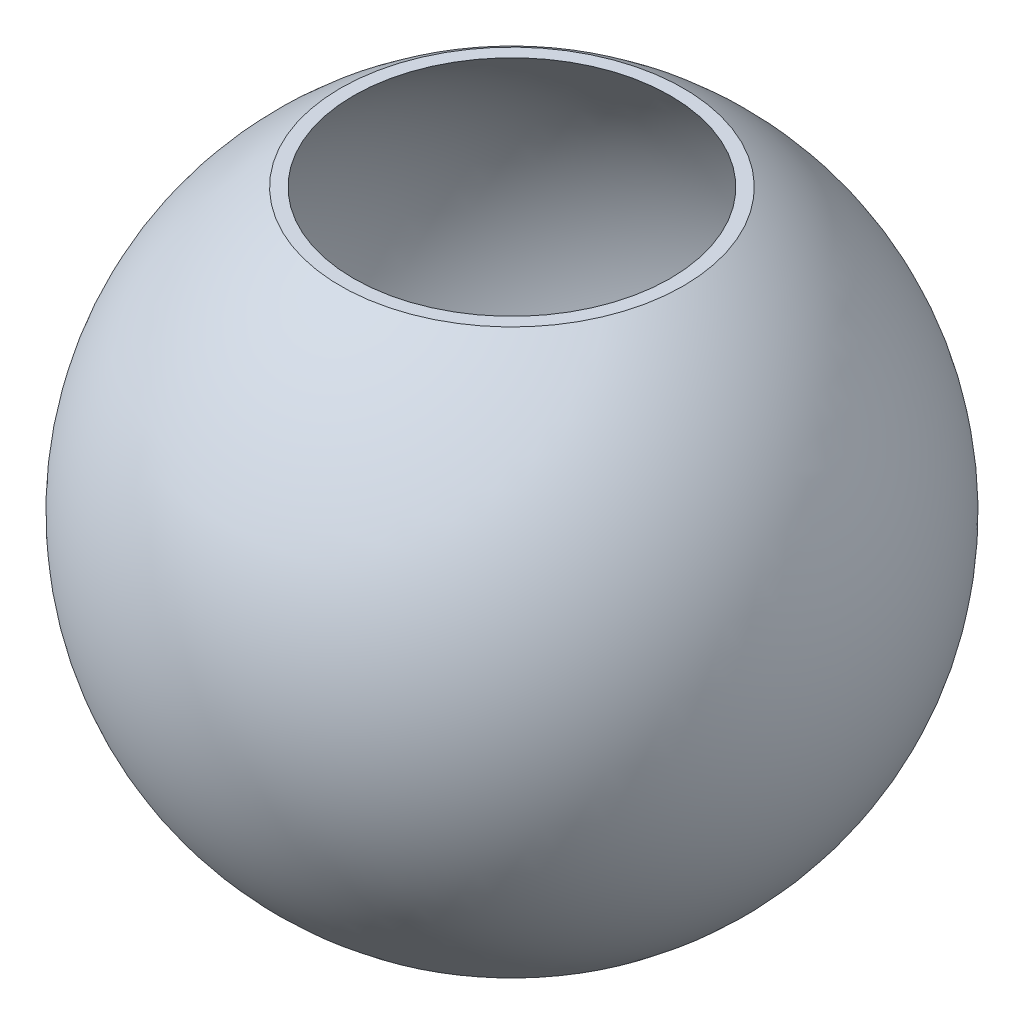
from build123d import *


with BuildPart() as part:
    # Szkic1 → Obr_t1 (revolve)
    with BuildSketch(Plane.XY):
        with BuildLine():
            Line((0, -50), (0, -49))
            ThreePointArc((0, -49), (47.400988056, -12.415568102), (24.020824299, 42.708313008))
            Line((24.020824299, 42.708313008), (26, 42.708313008))
            ThreePointArc((26, 42.708313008), (48.142578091, -13.501561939), (0, -50))
        make_face()
    revolve(axis=Axis((0, 42.708313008, 0), (0, -1, 0)))


solid = part.part
